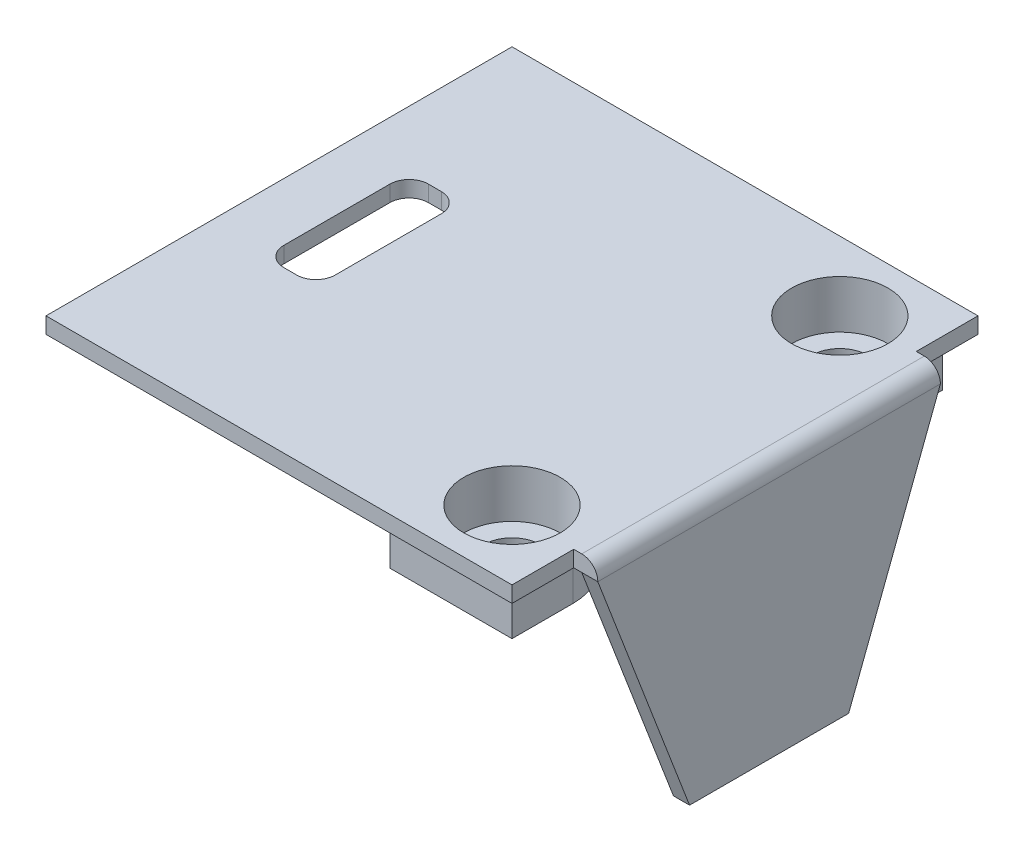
ISO-10303-21;
HEADER;
FILE_DESCRIPTION(('STEP AP214'),'2;1');
FILE_NAME('part.step','',(''),(''),'','','');
FILE_SCHEMA(('AUTOMOTIVE_DESIGN { 1 0 10303 214 1 1 1 1 }'));
ENDSEC;
DATA;
#1=APPLICATION_CONTEXT('core data for automotive mechanical design processes');
#2=APPLICATION_PROTOCOL_DEFINITION('international standard','automotive_design',2000,#1);
#3=PRODUCT_CONTEXT('',#1,'mechanical');
#4=PRODUCT('Part','Part','',(#3));
#5=PRODUCT_RELATED_PRODUCT_CATEGORY('part','',(#4));
#6=PRODUCT_DEFINITION_FORMATION('','',#4);
#7=PRODUCT_DEFINITION_CONTEXT('part definition',#1,'design');
#8=PRODUCT_DEFINITION('design','',#6,#7);
#9=PRODUCT_DEFINITION_SHAPE('','',#8);
#10=(LENGTH_UNIT() NAMED_UNIT(*) SI_UNIT(.MILLI.,.METRE.));
#11=(NAMED_UNIT(*) PLANE_ANGLE_UNIT() SI_UNIT($,.RADIAN.));
#12=(NAMED_UNIT(*) SI_UNIT($,.STERADIAN.) SOLID_ANGLE_UNIT());
#13=UNCERTAINTY_MEASURE_WITH_UNIT(LENGTH_MEASURE(1.E-05),#10,'distance_accuracy_value','');
#14=(GEOMETRIC_REPRESENTATION_CONTEXT(3) GLOBAL_UNCERTAINTY_ASSIGNED_CONTEXT((#13)) GLOBAL_UNIT_ASSIGNED_CONTEXT((#10,
#11,#12)) REPRESENTATION_CONTEXT('',''));
#15=CARTESIAN_POINT('',(0.,0.,0.));
#16=DIRECTION('',(0.,0.,1.));
#17=DIRECTION('',(1.,0.,0.));
#18=AXIS2_PLACEMENT_3D('',#15,#16,#17);
#19=CARTESIAN_POINT('',(10.2,-7.94974746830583,-10.2));
#20=DIRECTION('',(0.,1.,0.));
#21=DIRECTION('',(0.,0.,1.));
#22=AXIS2_PLACEMENT_3D('',#19,#20,#21);
#23=CYLINDRICAL_SURFACE('',#22,1.75);
#24=CARTESIAN_POINT('',(10.2,-3.,-10.2));
#25=DIRECTION('',(0.,-1.,0.));
#26=DIRECTION('',(0.,0.,-1.));
#27=AXIS2_PLACEMENT_3D('',#24,#25,#26);
#28=CIRCLE('',#27,1.75);
#29=CARTESIAN_POINT('',(10.2,-3.,-11.95));
#30=VERTEX_POINT('',#29);
#31=EDGE_CURVE('E305',#30,#30,#28,.T.);
#32=ORIENTED_EDGE('',*,*,#31,.T.);
#33=EDGE_LOOP('',(#32));
#34=FACE_BOUND('',#33,.T.);
#35=CARTESIAN_POINT('',(10.2,-2.,-10.2));
#36=DIRECTION('',(0.,1.,0.));
#37=DIRECTION('',(0.,0.,1.));
#38=AXIS2_PLACEMENT_3D('',#35,#36,#37);
#39=CIRCLE('',#38,1.75);
#40=CARTESIAN_POINT('',(10.2,-2.,-8.45));
#41=VERTEX_POINT('',#40);
#42=EDGE_CURVE('E302',#41,#41,#39,.T.);
#43=ORIENTED_EDGE('',*,*,#42,.T.);
#44=EDGE_LOOP('',(#43));
#45=FACE_BOUND('',#44,.T.);
#46=ADVANCED_FACE('F37',(#34,#45),#23,.F.);
#47=CARTESIAN_POINT('',(10.2,-7.94974746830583,10.2));
#48=DIRECTION('',(0.,1.,0.));
#49=DIRECTION('',(0.,0.,1.));
#50=AXIS2_PLACEMENT_3D('',#47,#48,#49);
#51=CYLINDRICAL_SURFACE('',#50,1.75);
#52=CARTESIAN_POINT('',(10.2,-3.,10.2));
#53=DIRECTION('',(0.,-1.,0.));
#54=DIRECTION('',(0.,0.,-1.));
#55=AXIS2_PLACEMENT_3D('',#52,#53,#54);
#56=CIRCLE('',#55,1.75);
#57=CARTESIAN_POINT('',(10.2,-3.,8.45));
#58=VERTEX_POINT('',#57);
#59=EDGE_CURVE('E347',#58,#58,#56,.F.);
#60=ORIENTED_EDGE('',*,*,#59,.F.);
#61=EDGE_LOOP('',(#60));
#62=FACE_BOUND('',#61,.T.);
#63=CARTESIAN_POINT('',(10.2,-2.,10.2));
#64=DIRECTION('',(0.,1.,0.));
#65=DIRECTION('',(0.,0.,1.));
#66=AXIS2_PLACEMENT_3D('',#63,#64,#65);
#67=CIRCLE('',#66,1.75);
#68=CARTESIAN_POINT('',(10.2,-2.,11.95));
#69=VERTEX_POINT('',#68);
#70=EDGE_CURVE('E344',#69,#69,#67,.F.);
#71=ORIENTED_EDGE('',*,*,#70,.F.);
#72=EDGE_LOOP('',(#71));
#73=FACE_BOUND('',#72,.T.);
#74=ADVANCED_FACE('F526',(#62,#73),#51,.F.);
#75=CARTESIAN_POINT('',(0.,0.,0.));
#76=DIRECTION('',(0.,-1.,0.));
#77=DIRECTION('',(0.,0.,-1.));
#78=AXIS2_PLACEMENT_3D('',#75,#76,#77);
#79=PLANE('',#78);
#80=DIRECTION('',(1.,0.,0.));
#81=VECTOR('',#80,1.);
#82=CARTESIAN_POINT('',(-9.7,0.,4.5));
#83=LINE('',#82,#81);
#84=CARTESIAN_POINT('',(-9.7,0.,4.5));
#85=VERTEX_POINT('',#84);
#86=CARTESIAN_POINT('',(-8.90000000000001,0.,4.5));
#87=VERTEX_POINT('',#86);
#88=EDGE_CURVE('E252',#85,#87,#83,.T.);
#89=ORIENTED_EDGE('',*,*,#88,.T.);
#90=CARTESIAN_POINT('',(-8.9,0.,3.3));
#91=DIRECTION('',(0.,-1.,0.));
#92=DIRECTION('',(0.,0.,-1.));
#93=AXIS2_PLACEMENT_3D('',#90,#91,#92);
#94=CIRCLE('',#93,1.2);
#95=CARTESIAN_POINT('',(-7.7,0.,3.29999999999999));
#96=VERTEX_POINT('',#95);
#97=EDGE_CURVE('E238',#87,#96,#94,.F.);
#98=ORIENTED_EDGE('',*,*,#97,.T.);
#99=DIRECTION('',(0.,0.,-1.));
#100=VECTOR('',#99,1.);
#101=CARTESIAN_POINT('',(-7.7,0.,-3.29999999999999));
#102=LINE('',#101,#100);
#103=CARTESIAN_POINT('',(-7.7,0.,-3.29999999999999));
#104=VERTEX_POINT('',#103);
#105=EDGE_CURVE('E288',#96,#104,#102,.T.);
#106=ORIENTED_EDGE('',*,*,#105,.T.);
#107=CARTESIAN_POINT('',(-8.9,0.,-3.3));
#108=DIRECTION('',(0.,-1.,0.));
#109=DIRECTION('',(0.,0.,-1.));
#110=AXIS2_PLACEMENT_3D('',#107,#108,#109);
#111=CIRCLE('',#110,1.2);
#112=CARTESIAN_POINT('',(-8.9,0.,-4.5));
#113=VERTEX_POINT('',#112);
#114=EDGE_CURVE('E284',#104,#113,#111,.F.);
#115=ORIENTED_EDGE('',*,*,#114,.T.);
#116=DIRECTION('',(-1.,0.,0.));
#117=VECTOR('',#116,1.);
#118=CARTESIAN_POINT('',(-9.7,0.,-4.5));
#119=LINE('',#118,#117);
#120=CARTESIAN_POINT('',(-9.7,0.,-4.5));
#121=VERTEX_POINT('',#120);
#122=EDGE_CURVE('E280',#113,#121,#119,.T.);
#123=ORIENTED_EDGE('',*,*,#122,.T.);
#124=CARTESIAN_POINT('',(-9.7,0.,-3.3));
#125=DIRECTION('',(0.,-1.,0.));
#126=DIRECTION('',(0.,0.,-1.));
#127=AXIS2_PLACEMENT_3D('',#124,#125,#126);
#128=CIRCLE('',#127,1.2);
#129=CARTESIAN_POINT('',(-10.9,0.,-3.29999999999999));
#130=VERTEX_POINT('',#129);
#131=EDGE_CURVE('E276',#121,#130,#128,.F.);
#132=ORIENTED_EDGE('',*,*,#131,.T.);
#133=DIRECTION('',(0.,0.,1.));
#134=VECTOR('',#133,1.);
#135=CARTESIAN_POINT('',(-10.9,0.,-3.29999999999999));
#136=LINE('',#135,#134);
#137=CARTESIAN_POINT('',(-10.9,0.,3.29999999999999));
#138=VERTEX_POINT('',#137);
#139=EDGE_CURVE('E273',#130,#138,#136,.T.);
#140=ORIENTED_EDGE('',*,*,#139,.T.);
#141=CARTESIAN_POINT('',(-9.7,0.,3.3));
#142=DIRECTION('',(0.,-1.,0.));
#143=DIRECTION('',(0.,0.,-1.));
#144=AXIS2_PLACEMENT_3D('',#141,#142,#143);
#145=CIRCLE('',#144,1.2);
#146=EDGE_CURVE('E261',#138,#85,#145,.F.);
#147=ORIENTED_EDGE('',*,*,#146,.T.);
#148=EDGE_LOOP('',(#89,#98,#106,#115,#123,#132,#140,#147));
#149=FACE_BOUND('',#148,.T.);
#150=CARTESIAN_POINT('',(9.6,0.,-9.6));
#151=DIRECTION('',(0.,1.,0.));
#152=DIRECTION('',(0.,0.,1.));
#153=AXIS2_PLACEMENT_3D('',#150,#151,#152);
#154=CIRCLE('',#153,3.8);
#155=CARTESIAN_POINT('',(5.8,0.,-9.6));
#156=VERTEX_POINT('',#155);
#157=CARTESIAN_POINT('',(13.4,0.,-9.6));
#158=VERTEX_POINT('',#157);
#159=EDGE_CURVE('E308',#156,#158,#154,.T.);
#160=ORIENTED_EDGE('',*,*,#159,.T.);
#161=DIRECTION('',(0.,0.,-1.));
#162=VECTOR('',#161,1.);
#163=CARTESIAN_POINT('',(13.4,0.,-9.6));
#164=LINE('',#163,#162);
#165=CARTESIAN_POINT('',(13.4,0.,-13.4));
#166=VERTEX_POINT('',#165);
#167=EDGE_CURVE('E313',#158,#166,#164,.T.);
#168=ORIENTED_EDGE('',*,*,#167,.T.);
#169=DIRECTION('',(-1.,0.,0.));
#170=VECTOR('',#169,1.);
#171=CARTESIAN_POINT('',(13.4,0.,-13.4));
#172=LINE('',#171,#170);
#173=CARTESIAN_POINT('',(5.8,0.,-13.4));
#174=VERTEX_POINT('',#173);
#175=EDGE_CURVE('E326',#166,#174,#172,.T.);
#176=ORIENTED_EDGE('',*,*,#175,.T.);
#177=DIRECTION('',(0.,0.,1.));
#178=VECTOR('',#177,1.);
#179=CARTESIAN_POINT('',(5.8,0.,-13.4));
#180=LINE('',#179,#178);
#181=EDGE_CURVE('E324',#174,#156,#180,.T.);
#182=ORIENTED_EDGE('',*,*,#181,.T.);
#183=EDGE_LOOP('',(#160,#168,#176,#182));
#184=FACE_BOUND('',#183,.T.);
#185=DIRECTION('',(0.,0.,1.));
#186=VECTOR('',#185,1.);
#187=CARTESIAN_POINT('',(-14.5,0.,-14.5));
#188=LINE('',#187,#186);
#189=CARTESIAN_POINT('',(-14.5,0.,-14.5));
#190=VERTEX_POINT('',#189);
#191=CARTESIAN_POINT('',(-14.5,0.,14.5));
#192=VERTEX_POINT('',#191);
#193=EDGE_CURVE('E449',#190,#192,#188,.T.);
#194=ORIENTED_EDGE('',*,*,#193,.F.);
#195=DIRECTION('',(-1.,0.,0.));
#196=VECTOR('',#195,1.);
#197=CARTESIAN_POINT('',(14.5,0.,-14.5));
#198=LINE('',#197,#196);
#199=CARTESIAN_POINT('',(14.5,0.,-14.5));
#200=VERTEX_POINT('',#199);
#201=EDGE_CURVE('E454',#200,#190,#198,.T.);
#202=ORIENTED_EDGE('',*,*,#201,.F.);
#203=DIRECTION('',(0.,0.,-1.));
#204=VECTOR('',#203,1.);
#205=CARTESIAN_POINT('',(14.5,0.,-14.5));
#206=LINE('',#205,#204);
#207=CARTESIAN_POINT('',(14.5,0.,-10.659553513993));
#208=VERTEX_POINT('',#207);
#209=EDGE_CURVE('E467',#208,#200,#206,.T.);
#210=ORIENTED_EDGE('',*,*,#209,.F.);
#211=DIRECTION('',(1.,0.,0.));
#212=VECTOR('',#211,1.);
#213=CARTESIAN_POINT('',(13.307113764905,0.,-10.659553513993));
#214=LINE('',#213,#212);
#215=CARTESIAN_POINT('',(15.0000000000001,0.,-10.659553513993));
#216=VERTEX_POINT('',#215);
#217=EDGE_CURVE('E393',#208,#216,#214,.T.);
#218=ORIENTED_EDGE('',*,*,#217,.T.);
#219=DIRECTION('',(0.,0.,1.));
#220=VECTOR('',#219,1.);
#221=CARTESIAN_POINT('',(15.0000000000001,0.,-10.659553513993));
#222=LINE('',#221,#220);
#223=CARTESIAN_POINT('',(15.0000000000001,0.,-10.0091862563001));
#224=VERTEX_POINT('',#223);
#225=EDGE_CURVE('E390',#216,#224,#222,.T.);
#226=ORIENTED_EDGE('',*,*,#225,.T.);
#227=DIRECTION('',(1.,0.,0.));
#228=VECTOR('',#227,1.);
#229=CARTESIAN_POINT('',(13.307113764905,0.,-10.0091862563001));
#230=LINE('',#229,#228);
#231=CARTESIAN_POINT('',(14.5,0.,-10.0091862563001));
#232=VERTEX_POINT('',#231);
#233=EDGE_CURVE('E382',#232,#224,#230,.T.);
#234=ORIENTED_EDGE('',*,*,#233,.F.);
#235=CARTESIAN_POINT('',(14.5,0.,10.0091862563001));
#236=VERTEX_POINT('',#235);
#237=EDGE_CURVE('E471',#236,#232,#206,.T.);
#238=ORIENTED_EDGE('',*,*,#237,.F.);
#239=DIRECTION('',(1.,0.,0.));
#240=VECTOR('',#239,1.);
#241=CARTESIAN_POINT('',(13.307113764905,0.,10.0091862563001));
#242=LINE('',#241,#240);
#243=CARTESIAN_POINT('',(15.0000000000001,0.,10.0091862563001));
#244=VERTEX_POINT('',#243);
#245=EDGE_CURVE('E380',#236,#244,#242,.T.);
#246=ORIENTED_EDGE('',*,*,#245,.T.);
#247=DIRECTION('',(0.,0.,1.));
#248=VECTOR('',#247,1.);
#249=CARTESIAN_POINT('',(15.0000000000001,0.,10.659553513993));
#250=LINE('',#249,#248);
#251=CARTESIAN_POINT('',(15.,0.,10.659553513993));
#252=VERTEX_POINT('',#251);
#253=EDGE_CURVE('E383',#244,#252,#250,.T.);
#254=ORIENTED_EDGE('',*,*,#253,.T.);
#255=DIRECTION('',(1.,0.,0.));
#256=VECTOR('',#255,1.);
#257=CARTESIAN_POINT('',(13.307113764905,0.,10.659553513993));
#258=LINE('',#257,#256);
#259=CARTESIAN_POINT('',(14.5,0.,10.659553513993));
#260=VERTEX_POINT('',#259);
#261=EDGE_CURVE('E384',#260,#252,#258,.T.);
#262=ORIENTED_EDGE('',*,*,#261,.F.);
#263=CARTESIAN_POINT('',(14.5,0.,14.5));
#264=VERTEX_POINT('',#263);
#265=EDGE_CURVE('E468',#264,#260,#206,.T.);
#266=ORIENTED_EDGE('',*,*,#265,.F.);
#267=DIRECTION('',(1.,0.,0.));
#268=VECTOR('',#267,1.);
#269=CARTESIAN_POINT('',(14.5,0.,14.5));
#270=LINE('',#269,#268);
#271=EDGE_CURVE('E465',#192,#264,#270,.T.);
#272=ORIENTED_EDGE('',*,*,#271,.F.);
#273=EDGE_LOOP('',(#194,#202,#210,#218,#226,#234,#238,#246,#254,#262,#266,#272));
#274=FACE_BOUND('',#273,.T.);
#275=DIRECTION('',(0.,0.,1.));
#276=VECTOR('',#275,1.);
#277=CARTESIAN_POINT('',(13.4,0.,9.6));
#278=LINE('',#277,#276);
#279=CARTESIAN_POINT('',(13.4,0.,9.6));
#280=VERTEX_POINT('',#279);
#281=CARTESIAN_POINT('',(13.4,0.,13.4));
#282=VERTEX_POINT('',#281);
#283=EDGE_CURVE('E364',#280,#282,#278,.T.);
#284=ORIENTED_EDGE('',*,*,#283,.F.);
#285=CARTESIAN_POINT('',(9.6,0.,9.6));
#286=DIRECTION('',(0.,-1.,0.));
#287=DIRECTION('',(0.,0.,-1.));
#288=AXIS2_PLACEMENT_3D('',#285,#286,#287);
#289=CIRCLE('',#288,3.8);
#290=CARTESIAN_POINT('',(5.8,0.,9.6));
#291=VERTEX_POINT('',#290);
#292=EDGE_CURVE('E350',#291,#280,#289,.T.);
#293=ORIENTED_EDGE('',*,*,#292,.F.);
#294=DIRECTION('',(0.,0.,-1.));
#295=VECTOR('',#294,1.);
#296=CARTESIAN_POINT('',(5.8,0.,13.4));
#297=LINE('',#296,#295);
#298=CARTESIAN_POINT('',(5.8,0.,13.4));
#299=VERTEX_POINT('',#298);
#300=EDGE_CURVE('E355',#299,#291,#297,.T.);
#301=ORIENTED_EDGE('',*,*,#300,.F.);
#302=DIRECTION('',(-1.,0.,0.));
#303=VECTOR('',#302,1.);
#304=CARTESIAN_POINT('',(13.4,0.,13.4));
#305=LINE('',#304,#303);
#306=EDGE_CURVE('E366',#282,#299,#305,.T.);
#307=ORIENTED_EDGE('',*,*,#306,.F.);
#308=EDGE_LOOP('',(#284,#293,#301,#307));
#309=FACE_BOUND('',#308,.T.);
#310=ADVANCED_FACE('F258',(#149,#184,#274,#309),#79,.T.);
#311=CARTESIAN_POINT('',(15.0000000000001,0.,0.));
#312=DIRECTION('',(-1.,0.,0.));
#313=DIRECTION('',(0.,-1.,0.));
#314=AXIS2_PLACEMENT_3D('',#311,#312,#313);
#315=PLANE('',#314);
#316=DIRECTION('',(0.,-0.933790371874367,-0.357820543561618));
#317=VECTOR('',#316,1.);
#318=CARTESIAN_POINT('',(15.,0.,10.659553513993));
#319=LINE('',#318,#317);
#320=CARTESIAN_POINT('',(15.,-14.9,4.95));
#321=VERTEX_POINT('',#320);
#322=EDGE_CURVE('E400',#252,#321,#319,.T.);
#323=ORIENTED_EDGE('',*,*,#322,.F.);
#324=ORIENTED_EDGE('',*,*,#253,.F.);
#325=DIRECTION('',(0.,0.939692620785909,0.342020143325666));
#326=VECTOR('',#325,1.);
#327=CARTESIAN_POINT('',(15.,-13.9,4.95));
#328=LINE('',#327,#326);
#329=CARTESIAN_POINT('',(15.,-13.9,4.95));
#330=VERTEX_POINT('',#329);
#331=EDGE_CURVE('E433',#330,#244,#328,.T.);
#332=ORIENTED_EDGE('',*,*,#331,.F.);
#333=DIRECTION('',(0.,0.,1.));
#334=VECTOR('',#333,1.);
#335=CARTESIAN_POINT('',(15.,-13.9,-4.95));
#336=LINE('',#335,#334);
#337=CARTESIAN_POINT('',(15.,-13.9,-4.95000000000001));
#338=VERTEX_POINT('',#337);
#339=EDGE_CURVE('E421',#338,#330,#336,.T.);
#340=ORIENTED_EDGE('',*,*,#339,.F.);
#341=DIRECTION('',(0.,-0.93969262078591,0.342020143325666));
#342=VECTOR('',#341,1.);
#343=CARTESIAN_POINT('',(15.0000000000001,1.,-10.3731564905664));
#344=LINE('',#343,#342);
#345=EDGE_CURVE('E484',#224,#338,#344,.T.);
#346=ORIENTED_EDGE('',*,*,#345,.F.);
#347=ORIENTED_EDGE('',*,*,#225,.F.);
#348=DIRECTION('',(0.,0.933790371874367,-0.357820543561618));
#349=VECTOR('',#348,1.);
#350=CARTESIAN_POINT('',(15.,0.,-10.659553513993));
#351=LINE('',#350,#349);
#352=CARTESIAN_POINT('',(15.,-14.9,-4.95000000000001));
#353=VERTEX_POINT('',#352);
#354=EDGE_CURVE('E407',#353,#216,#351,.T.);
#355=ORIENTED_EDGE('',*,*,#354,.F.);
#356=DIRECTION('',(0.,0.,-1.));
#357=VECTOR('',#356,1.);
#358=CARTESIAN_POINT('',(15.,-14.9,-4.95000000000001));
#359=LINE('',#358,#357);
#360=EDGE_CURVE('E403',#321,#353,#359,.T.);
#361=ORIENTED_EDGE('',*,*,#360,.F.);
#362=EDGE_LOOP('',(#323,#324,#332,#340,#346,#347,#355,#361));
#363=FACE_BOUND('',#362,.T.);
#364=ADVANCED_FACE('F587',(#363),#315,.T.);
#365=CARTESIAN_POINT('',(14.5,1.,-14.5));
#366=DIRECTION('',(-1.,0.,0.));
#367=DIRECTION('',(0.,0.,1.));
#368=AXIS2_PLACEMENT_3D('',#365,#366,#367);
#369=PLANE('',#368);
#370=DIRECTION('',(0.,1.,0.));
#371=VECTOR('',#370,1.);
#372=CARTESIAN_POINT('',(14.5,1.00000000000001,10.659553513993));
#373=LINE('',#372,#371);
#374=CARTESIAN_POINT('',(14.5,1.,10.659553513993));
#375=VERTEX_POINT('',#374);
#376=EDGE_CURVE('E379',#260,#375,#373,.T.);
#377=ORIENTED_EDGE('',*,*,#376,.T.);
#378=DIRECTION('',(0.,0.,-1.));
#379=VECTOR('',#378,1.);
#380=CARTESIAN_POINT('',(14.5,1.,-14.5));
#381=LINE('',#380,#379);
#382=CARTESIAN_POINT('',(14.5,1.,14.5));
#383=VERTEX_POINT('',#382);
#384=EDGE_CURVE('E457',#383,#375,#381,.T.);
#385=ORIENTED_EDGE('',*,*,#384,.F.);
#386=DIRECTION('',(0.,-1.,0.));
#387=VECTOR('',#386,1.);
#388=CARTESIAN_POINT('',(14.5,1.,14.5));
#389=LINE('',#388,#387);
#390=EDGE_CURVE('E478',#383,#264,#389,.T.);
#391=ORIENTED_EDGE('',*,*,#390,.T.);
#392=ORIENTED_EDGE('',*,*,#265,.T.);
#393=EDGE_LOOP('',(#377,#385,#391,#392));
#394=FACE_BOUND('',#393,.T.);
#395=ADVANCED_FACE('F590',(#394),#369,.F.);
#396=CARTESIAN_POINT('',(16.,-13.9,4.95));
#397=DIRECTION('',(0.,0.342020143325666,-0.939692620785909));
#398=DIRECTION('',(0.,0.939692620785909,0.342020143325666));
#399=AXIS2_PLACEMENT_3D('',#396,#397,#398);
#400=PLANE('',#399);
#401=ORIENTED_EDGE('',*,*,#245,.F.);
#402=DIRECTION('',(0.,-0.939692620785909,-0.342020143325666));
#403=VECTOR('',#402,1.);
#404=CARTESIAN_POINT('',(14.5,-13.9,4.95));
#405=LINE('',#404,#403);
#406=CARTESIAN_POINT('',(14.5,-13.9,4.95));
#407=VERTEX_POINT('',#406);
#408=EDGE_CURVE('E436',#236,#407,#405,.T.);
#409=ORIENTED_EDGE('',*,*,#408,.T.);
#410=DIRECTION('',(-1.,0.,0.));
#411=VECTOR('',#410,1.);
#412=CARTESIAN_POINT('',(16.,-13.9,4.95));
#413=LINE('',#412,#411);
#414=EDGE_CURVE('E447',#330,#407,#413,.T.);
#415=ORIENTED_EDGE('',*,*,#414,.F.);
#416=ORIENTED_EDGE('',*,*,#331,.T.);
#417=EDGE_LOOP('',(#401,#409,#415,#416));
#418=FACE_BOUND('',#417,.T.);
#419=ADVANCED_FACE('F619',(#418),#400,.F.);
#420=DIRECTION('',(0.,-1.,0.));
#421=VECTOR('',#420,1.);
#422=CARTESIAN_POINT('',(14.5,1.00000000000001,-10.659553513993));
#423=LINE('',#422,#421);
#424=CARTESIAN_POINT('',(14.5,1.,-10.659553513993));
#425=VERTEX_POINT('',#424);
#426=EDGE_CURVE('E392',#425,#208,#423,.T.);
#427=ORIENTED_EDGE('',*,*,#426,.T.);
#428=ORIENTED_EDGE('',*,*,#209,.T.);
#429=DIRECTION('',(0.,-1.,0.));
#430=VECTOR('',#429,1.);
#431=CARTESIAN_POINT('',(14.5,1.,-14.5));
#432=LINE('',#431,#430);
#433=CARTESIAN_POINT('',(14.5,1.,-14.5));
#434=VERTEX_POINT('',#433);
#435=EDGE_CURVE('E475',#434,#200,#432,.T.);
#436=ORIENTED_EDGE('',*,*,#435,.F.);
#437=EDGE_CURVE('E456',#425,#434,#381,.T.);
#438=ORIENTED_EDGE('',*,*,#437,.F.);
#439=EDGE_LOOP('',(#427,#428,#436,#438));
#440=FACE_BOUND('',#439,.T.);
#441=ADVANCED_FACE('F613',(#440),#369,.F.);
#442=CARTESIAN_POINT('',(16.,1.,-10.3731564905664));
#443=DIRECTION('',(0.,0.342020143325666,0.939692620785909));
#444=DIRECTION('',(0.,-0.93969262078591,0.342020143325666));
#445=AXIS2_PLACEMENT_3D('',#442,#443,#444);
#446=PLANE('',#445);
#447=ORIENTED_EDGE('',*,*,#233,.T.);
#448=ORIENTED_EDGE('',*,*,#345,.T.);
#449=DIRECTION('',(-1.,0.,0.));
#450=VECTOR('',#449,1.);
#451=CARTESIAN_POINT('',(16.,-13.9,-4.95));
#452=LINE('',#451,#450);
#453=CARTESIAN_POINT('',(14.5,-13.9,-4.95));
#454=VERTEX_POINT('',#453);
#455=EDGE_CURVE('E445',#338,#454,#452,.T.);
#456=ORIENTED_EDGE('',*,*,#455,.T.);
#457=DIRECTION('',(0.,0.93969262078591,-0.342020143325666));
#458=VECTOR('',#457,1.);
#459=CARTESIAN_POINT('',(14.5,1.,-10.3731564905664));
#460=LINE('',#459,#458);
#461=EDGE_CURVE('E442',#454,#232,#460,.T.);
#462=ORIENTED_EDGE('',*,*,#461,.T.);
#463=EDGE_LOOP('',(#447,#448,#456,#462));
#464=FACE_BOUND('',#463,.T.);
#465=ADVANCED_FACE('F609',(#464),#446,.F.);
#466=CARTESIAN_POINT('',(-14.5,1.,-14.5));
#467=DIRECTION('',(1.,0.,0.));
#468=DIRECTION('',(0.,0.,-1.));
#469=AXIS2_PLACEMENT_3D('',#466,#467,#468);
#470=PLANE('',#469);
#471=ORIENTED_EDGE('',*,*,#193,.T.);
#472=DIRECTION('',(0.,-1.,0.));
#473=VECTOR('',#472,1.);
#474=CARTESIAN_POINT('',(-14.5,1.,14.5));
#475=LINE('',#474,#473);
#476=CARTESIAN_POINT('',(-14.5,1.,14.5));
#477=VERTEX_POINT('',#476);
#478=EDGE_CURVE('E481',#477,#192,#475,.T.);
#479=ORIENTED_EDGE('',*,*,#478,.F.);
#480=DIRECTION('',(0.,0.,1.));
#481=VECTOR('',#480,1.);
#482=CARTESIAN_POINT('',(-14.5,1.,-14.5));
#483=LINE('',#482,#481);
#484=CARTESIAN_POINT('',(-14.5,1.,-14.5));
#485=VERTEX_POINT('',#484);
#486=EDGE_CURVE('E450',#485,#477,#483,.T.);
#487=ORIENTED_EDGE('',*,*,#486,.F.);
#488=DIRECTION('',(0.,-1.,0.));
#489=VECTOR('',#488,1.);
#490=CARTESIAN_POINT('',(-14.5,1.,-14.5));
#491=LINE('',#490,#489);
#492=EDGE_CURVE('E462',#485,#190,#491,.T.);
#493=ORIENTED_EDGE('',*,*,#492,.T.);
#494=EDGE_LOOP('',(#471,#479,#487,#493));
#495=FACE_BOUND('',#494,.T.);
#496=ADVANCED_FACE('F612',(#495),#470,.F.);
#497=CARTESIAN_POINT('',(14.5,1.,14.5));
#498=DIRECTION('',(0.,0.,-1.));
#499=DIRECTION('',(-1.,0.,0.));
#500=AXIS2_PLACEMENT_3D('',#497,#498,#499);
#501=PLANE('',#500);
#502=ORIENTED_EDGE('',*,*,#271,.T.);
#503=ORIENTED_EDGE('',*,*,#390,.F.);
#504=DIRECTION('',(1.,0.,0.));
#505=VECTOR('',#504,1.);
#506=CARTESIAN_POINT('',(14.5,1.,14.5));
#507=LINE('',#506,#505);
#508=EDGE_CURVE('E453',#477,#383,#507,.T.);
#509=ORIENTED_EDGE('',*,*,#508,.F.);
#510=ORIENTED_EDGE('',*,*,#478,.T.);
#511=EDGE_LOOP('',(#502,#503,#509,#510));
#512=FACE_BOUND('',#511,.T.);
#513=ADVANCED_FACE('F631',(#512),#501,.F.);
#514=CARTESIAN_POINT('',(14.5,1.,-14.5));
#515=DIRECTION('',(0.,0.,1.));
#516=DIRECTION('',(1.,0.,0.));
#517=AXIS2_PLACEMENT_3D('',#514,#515,#516);
#518=PLANE('',#517);
#519=ORIENTED_EDGE('',*,*,#201,.T.);
#520=ORIENTED_EDGE('',*,*,#492,.F.);
#521=DIRECTION('',(-1.,0.,0.));
#522=VECTOR('',#521,1.);
#523=CARTESIAN_POINT('',(14.5,1.,-14.5));
#524=LINE('',#523,#522);
#525=EDGE_CURVE('E460',#434,#485,#524,.T.);
#526=ORIENTED_EDGE('',*,*,#525,.F.);
#527=ORIENTED_EDGE('',*,*,#435,.T.);
#528=EDGE_LOOP('',(#519,#520,#526,#527));
#529=FACE_BOUND('',#528,.T.);
#530=ADVANCED_FACE('F625',(#529),#518,.F.);
#531=CARTESIAN_POINT('',(0.,1.,0.));
#532=DIRECTION('',(0.,-1.,0.));
#533=DIRECTION('',(0.,0.,-1.));
#534=AXIS2_PLACEMENT_3D('',#531,#532,#533);
#535=PLANE('',#534);
#536=CARTESIAN_POINT('',(-8.9,1.,3.3));
#537=DIRECTION('',(0.,1.,0.));
#538=DIRECTION('',(0.,0.,1.));
#539=AXIS2_PLACEMENT_3D('',#536,#537,#538);
#540=CIRCLE('',#539,1.2);
#541=CARTESIAN_POINT('',(-8.90000000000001,1.,4.5));
#542=VERTEX_POINT('',#541);
#543=CARTESIAN_POINT('',(-7.7,1.,3.29999999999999));
#544=VERTEX_POINT('',#543);
#545=EDGE_CURVE('E1064',#542,#544,#540,.T.);
#546=ORIENTED_EDGE('',*,*,#545,.F.);
#547=DIRECTION('',(1.,0.,0.));
#548=VECTOR('',#547,1.);
#549=CARTESIAN_POINT('',(-9.7,1.,4.5));
#550=LINE('',#549,#548);
#551=CARTESIAN_POINT('',(-9.7,1.,4.5));
#552=VERTEX_POINT('',#551);
#553=EDGE_CURVE('E255',#552,#542,#550,.T.);
#554=ORIENTED_EDGE('',*,*,#553,.F.);
#555=CARTESIAN_POINT('',(-9.7,1.,3.3));
#556=DIRECTION('',(0.,1.,0.));
#557=DIRECTION('',(0.,0.,1.));
#558=AXIS2_PLACEMENT_3D('',#555,#556,#557);
#559=CIRCLE('',#558,1.2);
#560=CARTESIAN_POINT('',(-10.9,1.,3.29999999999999));
#561=VERTEX_POINT('',#560);
#562=EDGE_CURVE('E268',#561,#552,#559,.T.);
#563=ORIENTED_EDGE('',*,*,#562,.F.);
#564=DIRECTION('',(0.,0.,1.));
#565=VECTOR('',#564,1.);
#566=CARTESIAN_POINT('',(-10.9,1.,-3.29999999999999));
#567=LINE('',#566,#565);
#568=CARTESIAN_POINT('',(-10.9,1.,-3.29999999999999));
#569=VERTEX_POINT('',#568);
#570=EDGE_CURVE('E262',#569,#561,#567,.T.);
#571=ORIENTED_EDGE('',*,*,#570,.F.);
#572=CARTESIAN_POINT('',(-9.7,1.,-3.3));
#573=DIRECTION('',(0.,1.,0.));
#574=DIRECTION('',(0.,0.,1.));
#575=AXIS2_PLACEMENT_3D('',#572,#573,#574);
#576=CIRCLE('',#575,1.2);
#577=CARTESIAN_POINT('',(-9.7,1.,-4.5));
#578=VERTEX_POINT('',#577);
#579=EDGE_CURVE('E264',#578,#569,#576,.T.);
#580=ORIENTED_EDGE('',*,*,#579,.F.);
#581=DIRECTION('',(-1.,0.,0.));
#582=VECTOR('',#581,1.);
#583=CARTESIAN_POINT('',(-9.7,1.,-4.5));
#584=LINE('',#583,#582);
#585=CARTESIAN_POINT('',(-8.90000000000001,1.,-4.5));
#586=VERTEX_POINT('',#585);
#587=EDGE_CURVE('E1059',#586,#578,#584,.T.);
#588=ORIENTED_EDGE('',*,*,#587,.F.);
#589=CARTESIAN_POINT('',(-8.9,1.,-3.3));
#590=DIRECTION('',(0.,1.,0.));
#591=DIRECTION('',(0.,0.,-1.));
#592=AXIS2_PLACEMENT_3D('',#589,#590,#591);
#593=CIRCLE('',#592,1.2);
#594=CARTESIAN_POINT('',(-7.7,1.,-3.29999999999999));
#595=VERTEX_POINT('',#594);
#596=EDGE_CURVE('E1070',#595,#586,#593,.T.);
#597=ORIENTED_EDGE('',*,*,#596,.F.);
#598=DIRECTION('',(0.,0.,-1.));
#599=VECTOR('',#598,1.);
#600=CARTESIAN_POINT('',(-7.7,1.,-3.29999999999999));
#601=LINE('',#600,#599);
#602=EDGE_CURVE('E1065',#544,#595,#601,.T.);
#603=ORIENTED_EDGE('',*,*,#602,.F.);
#604=EDGE_LOOP('',(#546,#554,#563,#571,#580,#588,#597,#603));
#605=FACE_BOUND('',#604,.T.);
#606=CARTESIAN_POINT('',(10.2,1.,-10.2));
#607=DIRECTION('',(0.,-1.,0.));
#608=DIRECTION('',(0.,0.,-1.));
#609=AXIS2_PLACEMENT_3D('',#606,#607,#608);
#610=CIRCLE('',#609,3.);
#611=CARTESIAN_POINT('',(10.2,1.,-13.2));
#612=VERTEX_POINT('',#611);
#613=EDGE_CURVE('E298',#612,#612,#610,.T.);
#614=ORIENTED_EDGE('',*,*,#613,.T.);
#615=EDGE_LOOP('',(#614));
#616=FACE_BOUND('',#615,.T.);
#617=CARTESIAN_POINT('',(10.2,1.,10.2));
#618=DIRECTION('',(0.,1.,0.));
#619=DIRECTION('',(0.,0.,1.));
#620=AXIS2_PLACEMENT_3D('',#617,#618,#619);
#621=CIRCLE('',#620,3.);
#622=CARTESIAN_POINT('',(10.2,1.,13.2));
#623=VERTEX_POINT('',#622);
#624=EDGE_CURVE('E340',#623,#623,#621,.T.);
#625=ORIENTED_EDGE('',*,*,#624,.F.);
#626=EDGE_LOOP('',(#625));
#627=FACE_BOUND('',#626,.T.);
#628=DIRECTION('',(1.,0.,0.));
#629=VECTOR('',#628,1.);
#630=CARTESIAN_POINT('',(15.,0.999999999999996,10.659553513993));
#631=LINE('',#630,#629);
#632=CARTESIAN_POINT('',(15.,0.999999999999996,10.659553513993));
#633=VERTEX_POINT('',#632);
#634=EDGE_CURVE('E428',#375,#633,#631,.T.);
#635=ORIENTED_EDGE('',*,*,#634,.T.);
#636=DIRECTION('',(0.,0.,1.));
#637=VECTOR('',#636,1.);
#638=CARTESIAN_POINT('',(15.,1.,0.));
#639=LINE('',#638,#637);
#640=CARTESIAN_POINT('',(15.,1.,-10.659553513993));
#641=VERTEX_POINT('',#640);
#642=EDGE_CURVE('E45',#633,#641,#639,.F.);
#643=ORIENTED_EDGE('',*,*,#642,.T.);
#644=DIRECTION('',(1.,0.,0.));
#645=VECTOR('',#644,1.);
#646=CARTESIAN_POINT('',(15.,1.,-10.659553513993));
#647=LINE('',#646,#645);
#648=EDGE_CURVE('E410',#425,#641,#647,.T.);
#649=ORIENTED_EDGE('',*,*,#648,.F.);
#650=ORIENTED_EDGE('',*,*,#437,.T.);
#651=ORIENTED_EDGE('',*,*,#525,.T.);
#652=ORIENTED_EDGE('',*,*,#486,.T.);
#653=ORIENTED_EDGE('',*,*,#508,.T.);
#654=ORIENTED_EDGE('',*,*,#384,.T.);
#655=EDGE_LOOP('',(#635,#643,#649,#650,#651,#652,#653,#654));
#656=FACE_BOUND('',#655,.T.);
#657=ADVANCED_FACE('F617',(#605,#616,#627,#656),#535,.F.);
#658=CARTESIAN_POINT('',(16.,-13.9,-4.95));
#659=DIRECTION('',(0.,1.,0.));
#660=DIRECTION('',(0.,0.,1.));
#661=AXIS2_PLACEMENT_3D('',#658,#659,#660);
#662=PLANE('',#661);
#663=ORIENTED_EDGE('',*,*,#455,.F.);
#664=ORIENTED_EDGE('',*,*,#339,.T.);
#665=ORIENTED_EDGE('',*,*,#414,.T.);
#666=DIRECTION('',(0.,0.,-1.));
#667=VECTOR('',#666,1.);
#668=CARTESIAN_POINT('',(14.5,-13.9,-4.95));
#669=LINE('',#668,#667);
#670=EDGE_CURVE('E439',#407,#454,#669,.T.);
#671=ORIENTED_EDGE('',*,*,#670,.T.);
#672=EDGE_LOOP('',(#663,#664,#665,#671));
#673=FACE_BOUND('',#672,.T.);
#674=ADVANCED_FACE('F605',(#673),#662,.F.);
#675=CARTESIAN_POINT('',(16.,0.,0.));
#676=DIRECTION('',(-1.,0.,0.));
#677=DIRECTION('',(0.,0.,1.));
#678=AXIS2_PLACEMENT_3D('',#675,#676,#677);
#679=PLANE('',#678);
#680=DIRECTION('',(0.,0.933790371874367,-0.357820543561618));
#681=VECTOR('',#680,1.);
#682=CARTESIAN_POINT('',(16.,0.,-10.659553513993));
#683=LINE('',#682,#681);
#684=CARTESIAN_POINT('',(16.,-14.9,-4.95000000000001));
#685=VERTEX_POINT('',#684);
#686=CARTESIAN_POINT('',(16.,0.,-10.659553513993));
#687=VERTEX_POINT('',#686);
#688=EDGE_CURVE('E404',#685,#687,#683,.T.);
#689=ORIENTED_EDGE('',*,*,#688,.T.);
#690=DIRECTION('',(0.,0.,1.));
#691=VECTOR('',#690,1.);
#692=CARTESIAN_POINT('',(16.,0.,0.));
#693=LINE('',#692,#691);
#694=CARTESIAN_POINT('',(16.,0.,10.659553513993));
#695=VERTEX_POINT('',#694);
#696=EDGE_CURVE('E486',#687,#695,#693,.T.);
#697=ORIENTED_EDGE('',*,*,#696,.T.);
#698=DIRECTION('',(0.,-0.933790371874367,-0.357820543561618));
#699=VECTOR('',#698,1.);
#700=CARTESIAN_POINT('',(16.,0.,10.659553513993));
#701=LINE('',#700,#699);
#702=CARTESIAN_POINT('',(16.,-14.9,4.95));
#703=VERTEX_POINT('',#702);
#704=EDGE_CURVE('E396',#695,#703,#701,.T.);
#705=ORIENTED_EDGE('',*,*,#704,.T.);
#706=DIRECTION('',(0.,0.,-1.));
#707=VECTOR('',#706,1.);
#708=CARTESIAN_POINT('',(16.,-14.9,-4.95000000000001));
#709=LINE('',#708,#707);
#710=EDGE_CURVE('E413',#703,#685,#709,.T.);
#711=ORIENTED_EDGE('',*,*,#710,.T.);
#712=EDGE_LOOP('',(#689,#697,#705,#711));
#713=FACE_BOUND('',#712,.T.);
#714=ADVANCED_FACE('F495',(#713),#679,.F.);
#715=CARTESIAN_POINT('',(14.5,0.,0.));
#716=DIRECTION('',(-1.,0.,0.));
#717=DIRECTION('',(0.,0.,1.));
#718=AXIS2_PLACEMENT_3D('',#715,#716,#717);
#719=PLANE('',#718);
#720=ORIENTED_EDGE('',*,*,#408,.F.);
#721=ORIENTED_EDGE('',*,*,#237,.T.);
#722=ORIENTED_EDGE('',*,*,#461,.F.);
#723=ORIENTED_EDGE('',*,*,#670,.F.);
#724=EDGE_LOOP('',(#720,#721,#722,#723));
#725=FACE_BOUND('',#724,.T.);
#726=ADVANCED_FACE('F602',(#725),#719,.T.);
#727=CARTESIAN_POINT('',(15.,1.,-10.659553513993));
#728=DIRECTION('',(0.,0.,-1.));
#729=DIRECTION('',(-1.,0.,0.));
#730=AXIS2_PLACEMENT_3D('',#727,#728,#729);
#731=PLANE('',#730);
#732=ORIENTED_EDGE('',*,*,#648,.T.);
#733=CARTESIAN_POINT('',(15.,0.,-10.659553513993));
#734=DIRECTION('',(0.,0.,-1.));
#735=DIRECTION('',(-1.,0.,0.));
#736=AXIS2_PLACEMENT_3D('',#733,#734,#735);
#737=CIRCLE('',#736,1.);
#738=EDGE_CURVE('E11',#641,#687,#737,.T.);
#739=ORIENTED_EDGE('',*,*,#738,.T.);
#740=DIRECTION('',(1.,0.,0.));
#741=VECTOR('',#740,1.);
#742=CARTESIAN_POINT('',(15.,0.,-10.659553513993));
#743=LINE('',#742,#741);
#744=EDGE_CURVE('E418',#216,#687,#743,.T.);
#745=ORIENTED_EDGE('',*,*,#744,.F.);
#746=ORIENTED_EDGE('',*,*,#217,.F.);
#747=ORIENTED_EDGE('',*,*,#426,.F.);
#748=EDGE_LOOP('',(#732,#739,#745,#746,#747));
#749=FACE_BOUND('',#748,.T.);
#750=ADVANCED_FACE('F515',(#749),#731,.T.);
#751=CARTESIAN_POINT('',(15.,0.,-10.659553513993));
#752=DIRECTION('',(0.,-0.357820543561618,-0.933790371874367));
#753=DIRECTION('',(0.,0.933790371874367,-0.357820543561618));
#754=AXIS2_PLACEMENT_3D('',#751,#752,#753);
#755=PLANE('',#754);
#756=ORIENTED_EDGE('',*,*,#688,.F.);
#757=DIRECTION('',(1.,0.,0.));
#758=VECTOR('',#757,1.);
#759=CARTESIAN_POINT('',(15.,-14.9,-4.95000000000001));
#760=LINE('',#759,#758);
#761=EDGE_CURVE('E422',#353,#685,#760,.T.);
#762=ORIENTED_EDGE('',*,*,#761,.F.);
#763=ORIENTED_EDGE('',*,*,#354,.T.);
#764=ORIENTED_EDGE('',*,*,#744,.T.);
#765=EDGE_LOOP('',(#756,#762,#763,#764));
#766=FACE_BOUND('',#765,.T.);
#767=ADVANCED_FACE('F511',(#766),#755,.T.);
#768=CARTESIAN_POINT('',(15.,-14.9,-4.95000000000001));
#769=DIRECTION('',(0.,-1.,0.));
#770=DIRECTION('',(1.,0.,0.));
#771=AXIS2_PLACEMENT_3D('',#768,#769,#770);
#772=PLANE('',#771);
#773=ORIENTED_EDGE('',*,*,#710,.F.);
#774=DIRECTION('',(1.,0.,0.));
#775=VECTOR('',#774,1.);
#776=CARTESIAN_POINT('',(15.,-14.9,4.95));
#777=LINE('',#776,#775);
#778=EDGE_CURVE('E424',#321,#703,#777,.T.);
#779=ORIENTED_EDGE('',*,*,#778,.F.);
#780=ORIENTED_EDGE('',*,*,#360,.T.);
#781=ORIENTED_EDGE('',*,*,#761,.T.);
#782=EDGE_LOOP('',(#773,#779,#780,#781));
#783=FACE_BOUND('',#782,.T.);
#784=ADVANCED_FACE('F509',(#783),#772,.T.);
#785=CARTESIAN_POINT('',(15.,0.,10.659553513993));
#786=DIRECTION('',(0.,-0.357820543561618,0.933790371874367));
#787=DIRECTION('',(0.,-0.933790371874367,-0.357820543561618));
#788=AXIS2_PLACEMENT_3D('',#785,#786,#787);
#789=PLANE('',#788);
#790=ORIENTED_EDGE('',*,*,#704,.F.);
#791=DIRECTION('',(1.,0.,0.));
#792=VECTOR('',#791,1.);
#793=CARTESIAN_POINT('',(15.,0.,10.659553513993));
#794=LINE('',#793,#792);
#795=EDGE_CURVE('E426',#252,#695,#794,.T.);
#796=ORIENTED_EDGE('',*,*,#795,.F.);
#797=ORIENTED_EDGE('',*,*,#322,.T.);
#798=ORIENTED_EDGE('',*,*,#778,.T.);
#799=EDGE_LOOP('',(#790,#796,#797,#798));
#800=FACE_BOUND('',#799,.T.);
#801=ADVANCED_FACE('F505',(#800),#789,.T.);
#802=CARTESIAN_POINT('',(15.,0.999999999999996,10.659553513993));
#803=DIRECTION('',(0.,0.,1.));
#804=DIRECTION('',(1.,0.,0.));
#805=AXIS2_PLACEMENT_3D('',#802,#803,#804);
#806=PLANE('',#805);
#807=ORIENTED_EDGE('',*,*,#795,.T.);
#808=CARTESIAN_POINT('',(15.,0.,10.659553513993));
#809=DIRECTION('',(0.,0.,1.));
#810=DIRECTION('',(1.,0.,0.));
#811=AXIS2_PLACEMENT_3D('',#808,#809,#810);
#812=CIRCLE('',#811,1.);
#813=EDGE_CURVE('E59',#695,#633,#812,.T.);
#814=ORIENTED_EDGE('',*,*,#813,.T.);
#815=ORIENTED_EDGE('',*,*,#634,.F.);
#816=ORIENTED_EDGE('',*,*,#376,.F.);
#817=ORIENTED_EDGE('',*,*,#261,.T.);
#818=EDGE_LOOP('',(#807,#814,#815,#816,#817));
#819=FACE_BOUND('',#818,.T.);
#820=ADVANCED_FACE('F501',(#819),#806,.T.);
#821=CARTESIAN_POINT('',(9.6,-3.,9.6));
#822=DIRECTION('',(0.,1.,0.));
#823=DIRECTION('',(0.,0.,1.));
#824=AXIS2_PLACEMENT_3D('',#821,#822,#823);
#825=CYLINDRICAL_SURFACE('',#824,3.8);
#826=ORIENTED_EDGE('',*,*,#292,.T.);
#827=DIRECTION('',(0.,1.,0.));
#828=VECTOR('',#827,1.);
#829=CARTESIAN_POINT('',(13.4,-3.,9.6));
#830=LINE('',#829,#828);
#831=CARTESIAN_POINT('',(13.4,-3.,9.6));
#832=VERTEX_POINT('',#831);
#833=EDGE_CURVE('E377',#832,#280,#830,.T.);
#834=ORIENTED_EDGE('',*,*,#833,.F.);
#835=CARTESIAN_POINT('',(9.6,-3.,9.6));
#836=DIRECTION('',(0.,-1.,0.));
#837=DIRECTION('',(0.,0.,-1.));
#838=AXIS2_PLACEMENT_3D('',#835,#836,#837);
#839=CIRCLE('',#838,3.8);
#840=CARTESIAN_POINT('',(5.8,-3.,9.6));
#841=VERTEX_POINT('',#840);
#842=EDGE_CURVE('E351',#841,#832,#839,.T.);
#843=ORIENTED_EDGE('',*,*,#842,.F.);
#844=DIRECTION('',(0.,1.,0.));
#845=VECTOR('',#844,1.);
#846=CARTESIAN_POINT('',(5.8,-3.,9.6));
#847=LINE('',#846,#845);
#848=EDGE_CURVE('E361',#841,#291,#847,.T.);
#849=ORIENTED_EDGE('',*,*,#848,.T.);
#850=EDGE_LOOP('',(#826,#834,#843,#849));
#851=FACE_BOUND('',#850,.T.);
#852=ADVANCED_FACE('F582',(#851),#825,.T.);
#853=CARTESIAN_POINT('',(13.4,-3.,9.6));
#854=DIRECTION('',(-1.,0.,0.));
#855=DIRECTION('',(0.,0.,1.));
#856=AXIS2_PLACEMENT_3D('',#853,#854,#855);
#857=PLANE('',#856);
#858=ORIENTED_EDGE('',*,*,#283,.T.);
#859=DIRECTION('',(0.,1.,0.));
#860=VECTOR('',#859,1.);
#861=CARTESIAN_POINT('',(13.4,-3.,13.4));
#862=LINE('',#861,#860);
#863=CARTESIAN_POINT('',(13.4,-3.,13.4));
#864=VERTEX_POINT('',#863);
#865=EDGE_CURVE('E374',#864,#282,#862,.T.);
#866=ORIENTED_EDGE('',*,*,#865,.F.);
#867=DIRECTION('',(0.,0.,1.));
#868=VECTOR('',#867,1.);
#869=CARTESIAN_POINT('',(13.4,-3.,9.6));
#870=LINE('',#869,#868);
#871=EDGE_CURVE('E354',#832,#864,#870,.T.);
#872=ORIENTED_EDGE('',*,*,#871,.F.);
#873=ORIENTED_EDGE('',*,*,#833,.T.);
#874=EDGE_LOOP('',(#858,#866,#872,#873));
#875=FACE_BOUND('',#874,.T.);
#876=ADVANCED_FACE('F578',(#875),#857,.F.);
#877=CARTESIAN_POINT('',(13.4,-3.,13.4));
#878=DIRECTION('',(0.,0.,-1.));
#879=DIRECTION('',(-1.,0.,0.));
#880=AXIS2_PLACEMENT_3D('',#877,#878,#879);
#881=PLANE('',#880);
#882=ORIENTED_EDGE('',*,*,#306,.T.);
#883=DIRECTION('',(0.,1.,0.));
#884=VECTOR('',#883,1.);
#885=CARTESIAN_POINT('',(5.8,-3.,13.4));
#886=LINE('',#885,#884);
#887=CARTESIAN_POINT('',(5.8,-3.,13.4));
#888=VERTEX_POINT('',#887);
#889=EDGE_CURVE('E372',#888,#299,#886,.T.);
#890=ORIENTED_EDGE('',*,*,#889,.F.);
#891=DIRECTION('',(-1.,0.,0.));
#892=VECTOR('',#891,1.);
#893=CARTESIAN_POINT('',(13.4,-3.,13.4));
#894=LINE('',#893,#892);
#895=EDGE_CURVE('E357',#864,#888,#894,.T.);
#896=ORIENTED_EDGE('',*,*,#895,.F.);
#897=ORIENTED_EDGE('',*,*,#865,.T.);
#898=EDGE_LOOP('',(#882,#890,#896,#897));
#899=FACE_BOUND('',#898,.T.);
#900=ADVANCED_FACE('F574',(#899),#881,.F.);
#901=CARTESIAN_POINT('',(5.8,-3.,13.4));
#902=DIRECTION('',(1.,0.,0.));
#903=DIRECTION('',(0.,0.,-1.));
#904=AXIS2_PLACEMENT_3D('',#901,#902,#903);
#905=PLANE('',#904);
#906=ORIENTED_EDGE('',*,*,#300,.T.);
#907=ORIENTED_EDGE('',*,*,#848,.F.);
#908=DIRECTION('',(0.,0.,-1.));
#909=VECTOR('',#908,1.);
#910=CARTESIAN_POINT('',(5.8,-3.,13.4));
#911=LINE('',#910,#909);
#912=EDGE_CURVE('E359',#888,#841,#911,.T.);
#913=ORIENTED_EDGE('',*,*,#912,.F.);
#914=ORIENTED_EDGE('',*,*,#889,.T.);
#915=EDGE_LOOP('',(#906,#907,#913,#914));
#916=FACE_BOUND('',#915,.T.);
#917=ADVANCED_FACE('F570',(#916),#905,.F.);
#918=CARTESIAN_POINT('',(9.6,-3.,9.6));
#919=DIRECTION('',(0.,-1.,0.));
#920=DIRECTION('',(0.,0.,-1.));
#921=AXIS2_PLACEMENT_3D('',#918,#919,#920);
#922=PLANE('',#921);
#923=ORIENTED_EDGE('',*,*,#59,.T.);
#924=EDGE_LOOP('',(#923));
#925=FACE_BOUND('',#924,.T.);
#926=ORIENTED_EDGE('',*,*,#842,.T.);
#927=ORIENTED_EDGE('',*,*,#871,.T.);
#928=ORIENTED_EDGE('',*,*,#895,.T.);
#929=ORIENTED_EDGE('',*,*,#912,.T.);
#930=EDGE_LOOP('',(#926,#927,#928,#929));
#931=FACE_BOUND('',#930,.T.);
#932=ADVANCED_FACE('F563',(#925,#931),#922,.T.);
#933=CARTESIAN_POINT('',(10.2,-2.,10.2));
#934=DIRECTION('',(0.,1.,0.));
#935=DIRECTION('',(0.,0.,1.));
#936=AXIS2_PLACEMENT_3D('',#933,#934,#935);
#937=PLANE('',#936);
#938=CARTESIAN_POINT('',(10.2,-2.,10.2));
#939=DIRECTION('',(0.,1.,0.));
#940=DIRECTION('',(0.,0.,1.));
#941=AXIS2_PLACEMENT_3D('',#938,#939,#940);
#942=CIRCLE('',#941,3.);
#943=CARTESIAN_POINT('',(10.2,-2.,13.2));
#944=VERTEX_POINT('',#943);
#945=EDGE_CURVE('E341',#944,#944,#942,.T.);
#946=ORIENTED_EDGE('',*,*,#945,.T.);
#947=EDGE_LOOP('',(#946));
#948=FACE_BOUND('',#947,.T.);
#949=ORIENTED_EDGE('',*,*,#70,.T.);
#950=EDGE_LOOP('',(#949));
#951=FACE_BOUND('',#950,.T.);
#952=ADVANCED_FACE('F560',(#948,#951),#937,.T.);
#953=CARTESIAN_POINT('',(10.2,-2.,10.2));
#954=DIRECTION('',(0.,1.,0.));
#955=DIRECTION('',(0.,0.,1.));
#956=AXIS2_PLACEMENT_3D('',#953,#954,#955);
#957=CYLINDRICAL_SURFACE('',#956,3.);
#958=ORIENTED_EDGE('',*,*,#945,.F.);
#959=EDGE_LOOP('',(#958));
#960=FACE_BOUND('',#959,.T.);
#961=ORIENTED_EDGE('',*,*,#624,.T.);
#962=EDGE_LOOP('',(#961));
#963=FACE_BOUND('',#962,.T.);
#964=ADVANCED_FACE('F558',(#960,#963),#957,.F.);
#965=CARTESIAN_POINT('',(9.6,-3.,-9.6));
#966=DIRECTION('',(0.,1.,0.));
#967=DIRECTION('',(0.,0.,1.));
#968=AXIS2_PLACEMENT_3D('',#965,#966,#967);
#969=CYLINDRICAL_SURFACE('',#968,3.8);
#970=ORIENTED_EDGE('',*,*,#159,.F.);
#971=DIRECTION('',(0.,1.,0.));
#972=VECTOR('',#971,1.);
#973=CARTESIAN_POINT('',(5.8,-3.,-9.6));
#974=LINE('',#973,#972);
#975=CARTESIAN_POINT('',(5.8,-3.,-9.6));
#976=VERTEX_POINT('',#975);
#977=EDGE_CURVE('E337',#976,#156,#974,.T.);
#978=ORIENTED_EDGE('',*,*,#977,.F.);
#979=CARTESIAN_POINT('',(9.6,-3.,-9.6));
#980=DIRECTION('',(0.,1.,0.));
#981=DIRECTION('',(0.,0.,1.));
#982=AXIS2_PLACEMENT_3D('',#979,#980,#981);
#983=CIRCLE('',#982,3.8);
#984=CARTESIAN_POINT('',(13.4,-3.,-9.6));
#985=VERTEX_POINT('',#984);
#986=EDGE_CURVE('E309',#976,#985,#983,.T.);
#987=ORIENTED_EDGE('',*,*,#986,.T.);
#988=DIRECTION('',(0.,1.,0.));
#989=VECTOR('',#988,1.);
#990=CARTESIAN_POINT('',(13.4,-3.,-9.6));
#991=LINE('',#990,#989);
#992=EDGE_CURVE('E322',#985,#158,#991,.T.);
#993=ORIENTED_EDGE('',*,*,#992,.T.);
#994=EDGE_LOOP('',(#970,#978,#987,#993));
#995=FACE_BOUND('',#994,.T.);
#996=ADVANCED_FACE('F554',(#995),#969,.T.);
#997=CARTESIAN_POINT('',(5.8,-3.,-13.4));
#998=DIRECTION('',(-1.,0.,0.));
#999=DIRECTION('',(0.,0.,1.));
#1000=AXIS2_PLACEMENT_3D('',#997,#998,#999);
#1001=PLANE('',#1000);
#1002=ORIENTED_EDGE('',*,*,#181,.F.);
#1003=DIRECTION('',(0.,1.,0.));
#1004=VECTOR('',#1003,1.);
#1005=CARTESIAN_POINT('',(5.8,-3.,-13.4));
#1006=LINE('',#1005,#1004);
#1007=CARTESIAN_POINT('',(5.8,-3.,-13.4));
#1008=VERTEX_POINT('',#1007);
#1009=EDGE_CURVE('E334',#1008,#174,#1006,.T.);
#1010=ORIENTED_EDGE('',*,*,#1009,.F.);
#1011=DIRECTION('',(0.,0.,1.));
#1012=VECTOR('',#1011,1.);
#1013=CARTESIAN_POINT('',(5.8,-3.,-13.4));
#1014=LINE('',#1013,#1012);
#1015=EDGE_CURVE('E312',#1008,#976,#1014,.T.);
#1016=ORIENTED_EDGE('',*,*,#1015,.T.);
#1017=ORIENTED_EDGE('',*,*,#977,.T.);
#1018=EDGE_LOOP('',(#1002,#1010,#1016,#1017));
#1019=FACE_BOUND('',#1018,.T.);
#1020=ADVANCED_FACE('F550',(#1019),#1001,.T.);
#1021=CARTESIAN_POINT('',(13.4,-3.,-13.4));
#1022=DIRECTION('',(0.,0.,-1.));
#1023=DIRECTION('',(-1.,0.,0.));
#1024=AXIS2_PLACEMENT_3D('',#1021,#1022,#1023);
#1025=PLANE('',#1024);
#1026=ORIENTED_EDGE('',*,*,#175,.F.);
#1027=DIRECTION('',(0.,1.,0.));
#1028=VECTOR('',#1027,1.);
#1029=CARTESIAN_POINT('',(13.4,-3.,-13.4));
#1030=LINE('',#1029,#1028);
#1031=CARTESIAN_POINT('',(13.4,-3.,-13.4));
#1032=VERTEX_POINT('',#1031);
#1033=EDGE_CURVE('E331',#1032,#166,#1030,.T.);
#1034=ORIENTED_EDGE('',*,*,#1033,.F.);
#1035=DIRECTION('',(-1.,0.,0.));
#1036=VECTOR('',#1035,1.);
#1037=CARTESIAN_POINT('',(13.4,-3.,-13.4));
#1038=LINE('',#1037,#1036);
#1039=EDGE_CURVE('E316',#1032,#1008,#1038,.T.);
#1040=ORIENTED_EDGE('',*,*,#1039,.T.);
#1041=ORIENTED_EDGE('',*,*,#1009,.T.);
#1042=EDGE_LOOP('',(#1026,#1034,#1040,#1041));
#1043=FACE_BOUND('',#1042,.T.);
#1044=ADVANCED_FACE('F546',(#1043),#1025,.T.);
#1045=CARTESIAN_POINT('',(13.4,-3.,-9.6));
#1046=DIRECTION('',(1.,0.,0.));
#1047=DIRECTION('',(0.,0.,-1.));
#1048=AXIS2_PLACEMENT_3D('',#1045,#1046,#1047);
#1049=PLANE('',#1048);
#1050=ORIENTED_EDGE('',*,*,#167,.F.);
#1051=ORIENTED_EDGE('',*,*,#992,.F.);
#1052=DIRECTION('',(0.,0.,-1.));
#1053=VECTOR('',#1052,1.);
#1054=CARTESIAN_POINT('',(13.4,-3.,-9.6));
#1055=LINE('',#1054,#1053);
#1056=EDGE_CURVE('E319',#985,#1032,#1055,.T.);
#1057=ORIENTED_EDGE('',*,*,#1056,.T.);
#1058=ORIENTED_EDGE('',*,*,#1033,.T.);
#1059=EDGE_LOOP('',(#1050,#1051,#1057,#1058));
#1060=FACE_BOUND('',#1059,.T.);
#1061=ADVANCED_FACE('F542',(#1060),#1049,.T.);
#1062=CARTESIAN_POINT('',(9.6,-3.,-9.6));
#1063=DIRECTION('',(0.,-1.,0.));
#1064=DIRECTION('',(0.,0.,1.));
#1065=AXIS2_PLACEMENT_3D('',#1062,#1063,#1064);
#1066=PLANE('',#1065);
#1067=ORIENTED_EDGE('',*,*,#31,.F.);
#1068=EDGE_LOOP('',(#1067));
#1069=FACE_BOUND('',#1068,.T.);
#1070=ORIENTED_EDGE('',*,*,#986,.F.);
#1071=ORIENTED_EDGE('',*,*,#1015,.F.);
#1072=ORIENTED_EDGE('',*,*,#1039,.F.);
#1073=ORIENTED_EDGE('',*,*,#1056,.F.);
#1074=EDGE_LOOP('',(#1070,#1071,#1072,#1073));
#1075=FACE_BOUND('',#1074,.T.);
#1076=ADVANCED_FACE('F539',(#1069,#1075),#1066,.T.);
#1077=CARTESIAN_POINT('',(10.2,-2.,-10.2));
#1078=DIRECTION('',(0.,1.,0.));
#1079=DIRECTION('',(0.,0.,1.));
#1080=AXIS2_PLACEMENT_3D('',#1077,#1078,#1079);
#1081=CYLINDRICAL_SURFACE('',#1080,3.);
#1082=CARTESIAN_POINT('',(10.2,-2.,-10.2));
#1083=DIRECTION('',(0.,-1.,0.));
#1084=DIRECTION('',(0.,0.,-1.));
#1085=AXIS2_PLACEMENT_3D('',#1082,#1083,#1084);
#1086=CIRCLE('',#1085,3.);
#1087=CARTESIAN_POINT('',(10.2,-2.,-13.2));
#1088=VERTEX_POINT('',#1087);
#1089=EDGE_CURVE('E299',#1088,#1088,#1086,.T.);
#1090=ORIENTED_EDGE('',*,*,#1089,.T.);
#1091=EDGE_LOOP('',(#1090));
#1092=FACE_BOUND('',#1091,.T.);
#1093=ORIENTED_EDGE('',*,*,#613,.F.);
#1094=EDGE_LOOP('',(#1093));
#1095=FACE_BOUND('',#1094,.T.);
#1096=ADVANCED_FACE('F537',(#1092,#1095),#1081,.F.);
#1097=CARTESIAN_POINT('',(10.2,-2.,-10.2));
#1098=DIRECTION('',(0.,1.,0.));
#1099=DIRECTION('',(0.,0.,-1.));
#1100=AXIS2_PLACEMENT_3D('',#1097,#1098,#1099);
#1101=PLANE('',#1100);
#1102=ORIENTED_EDGE('',*,*,#42,.F.);
#1103=EDGE_LOOP('',(#1102));
#1104=FACE_BOUND('',#1103,.T.);
#1105=ORIENTED_EDGE('',*,*,#1089,.F.);
#1106=EDGE_LOOP('',(#1105));
#1107=FACE_BOUND('',#1106,.T.);
#1108=ADVANCED_FACE('F797',(#1104,#1107),#1101,.T.);
#1109=CARTESIAN_POINT('',(-9.7,-9.55196314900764,4.5));
#1110=DIRECTION('',(0.,0.,1.));
#1111=DIRECTION('',(1.,0.,0.));
#1112=AXIS2_PLACEMENT_3D('',#1109,#1110,#1111);
#1113=PLANE('',#1112);
#1114=DIRECTION('',(0.,1.,0.));
#1115=VECTOR('',#1114,1.);
#1116=CARTESIAN_POINT('',(-9.7,-9.55196314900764,4.5));
#1117=LINE('',#1116,#1115);
#1118=EDGE_CURVE('E271',#85,#552,#1117,.T.);
#1119=ORIENTED_EDGE('',*,*,#1118,.T.);
#1120=ORIENTED_EDGE('',*,*,#553,.T.);
#1121=DIRECTION('',(0.,1.,0.));
#1122=VECTOR('',#1121,1.);
#1123=CARTESIAN_POINT('',(-8.90000000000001,-9.55196314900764,4.5));
#1124=LINE('',#1123,#1122);
#1125=EDGE_CURVE('E242',#87,#542,#1124,.T.);
#1126=ORIENTED_EDGE('',*,*,#1125,.F.);
#1127=ORIENTED_EDGE('',*,*,#88,.F.);
#1128=EDGE_LOOP('',(#1119,#1120,#1126,#1127));
#1129=FACE_BOUND('',#1128,.T.);
#1130=ADVANCED_FACE('F251',(#1129),#1113,.F.);
#1131=CARTESIAN_POINT('',(-8.9,-9.55196314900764,3.3));
#1132=DIRECTION('',(0.,1.,0.));
#1133=DIRECTION('',(0.,0.,1.));
#1134=AXIS2_PLACEMENT_3D('',#1131,#1132,#1133);
#1135=CYLINDRICAL_SURFACE('',#1134,1.2);
#1136=ORIENTED_EDGE('',*,*,#1125,.T.);
#1137=ORIENTED_EDGE('',*,*,#545,.T.);
#1138=DIRECTION('',(0.,1.,0.));
#1139=VECTOR('',#1138,1.);
#1140=CARTESIAN_POINT('',(-7.7,-9.55196314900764,3.29999999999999));
#1141=LINE('',#1140,#1139);
#1142=EDGE_CURVE('E244',#96,#544,#1141,.T.);
#1143=ORIENTED_EDGE('',*,*,#1142,.F.);
#1144=ORIENTED_EDGE('',*,*,#97,.F.);
#1145=EDGE_LOOP('',(#1136,#1137,#1143,#1144));
#1146=FACE_BOUND('',#1145,.T.);
#1147=ADVANCED_FACE('F240',(#1146),#1135,.F.);
#1148=CARTESIAN_POINT('',(-7.7,-9.55196314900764,-3.29999999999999));
#1149=DIRECTION('',(1.,0.,0.));
#1150=DIRECTION('',(0.,0.,-1.));
#1151=AXIS2_PLACEMENT_3D('',#1148,#1149,#1150);
#1152=PLANE('',#1151);
#1153=ORIENTED_EDGE('',*,*,#1142,.T.);
#1154=ORIENTED_EDGE('',*,*,#602,.T.);
#1155=DIRECTION('',(0.,1.,0.));
#1156=VECTOR('',#1155,1.);
#1157=CARTESIAN_POINT('',(-7.7,-9.55196314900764,-3.29999999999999));
#1158=LINE('',#1157,#1156);
#1159=EDGE_CURVE('E287',#104,#595,#1158,.T.);
#1160=ORIENTED_EDGE('',*,*,#1159,.F.);
#1161=ORIENTED_EDGE('',*,*,#105,.F.);
#1162=EDGE_LOOP('',(#1153,#1154,#1160,#1161));
#1163=FACE_BOUND('',#1162,.T.);
#1164=ADVANCED_FACE('F827',(#1163),#1152,.F.);
#1165=CARTESIAN_POINT('',(-8.9,-9.55196314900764,-3.3));
#1166=DIRECTION('',(0.,1.,0.));
#1167=DIRECTION('',(0.,0.,1.));
#1168=AXIS2_PLACEMENT_3D('',#1165,#1166,#1167);
#1169=CYLINDRICAL_SURFACE('',#1168,1.2);
#1170=ORIENTED_EDGE('',*,*,#1159,.T.);
#1171=ORIENTED_EDGE('',*,*,#596,.T.);
#1172=DIRECTION('',(0.,1.,0.));
#1173=VECTOR('',#1172,1.);
#1174=CARTESIAN_POINT('',(-8.90000000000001,-9.55196314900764,-4.5));
#1175=LINE('',#1174,#1173);
#1176=EDGE_CURVE('E283',#113,#586,#1175,.T.);
#1177=ORIENTED_EDGE('',*,*,#1176,.F.);
#1178=ORIENTED_EDGE('',*,*,#114,.F.);
#1179=EDGE_LOOP('',(#1170,#1171,#1177,#1178));
#1180=FACE_BOUND('',#1179,.T.);
#1181=ADVANCED_FACE('F837',(#1180),#1169,.F.);
#1182=CARTESIAN_POINT('',(-9.7,-9.55196314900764,-4.5));
#1183=DIRECTION('',(0.,0.,-1.));
#1184=DIRECTION('',(-1.,0.,0.));
#1185=AXIS2_PLACEMENT_3D('',#1182,#1183,#1184);
#1186=PLANE('',#1185);
#1187=ORIENTED_EDGE('',*,*,#1176,.T.);
#1188=ORIENTED_EDGE('',*,*,#587,.T.);
#1189=DIRECTION('',(0.,1.,0.));
#1190=VECTOR('',#1189,1.);
#1191=CARTESIAN_POINT('',(-9.7,-9.55196314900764,-4.5));
#1192=LINE('',#1191,#1190);
#1193=EDGE_CURVE('E279',#121,#578,#1192,.T.);
#1194=ORIENTED_EDGE('',*,*,#1193,.F.);
#1195=ORIENTED_EDGE('',*,*,#122,.F.);
#1196=EDGE_LOOP('',(#1187,#1188,#1194,#1195));
#1197=FACE_BOUND('',#1196,.T.);
#1198=ADVANCED_FACE('F848',(#1197),#1186,.F.);
#1199=CARTESIAN_POINT('',(-9.7,-9.55196314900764,-3.3));
#1200=DIRECTION('',(0.,1.,0.));
#1201=DIRECTION('',(0.,0.,1.));
#1202=AXIS2_PLACEMENT_3D('',#1199,#1200,#1201);
#1203=CYLINDRICAL_SURFACE('',#1202,1.2);
#1204=ORIENTED_EDGE('',*,*,#1193,.T.);
#1205=ORIENTED_EDGE('',*,*,#579,.T.);
#1206=DIRECTION('',(0.,1.,0.));
#1207=VECTOR('',#1206,1.);
#1208=CARTESIAN_POINT('',(-10.9,-9.55196314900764,-3.29999999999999));
#1209=LINE('',#1208,#1207);
#1210=EDGE_CURVE('E275',#130,#569,#1209,.T.);
#1211=ORIENTED_EDGE('',*,*,#1210,.F.);
#1212=ORIENTED_EDGE('',*,*,#131,.F.);
#1213=EDGE_LOOP('',(#1204,#1205,#1211,#1212));
#1214=FACE_BOUND('',#1213,.T.);
#1215=ADVANCED_FACE('F859',(#1214),#1203,.F.);
#1216=CARTESIAN_POINT('',(-10.9,-9.55196314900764,-3.29999999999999));
#1217=DIRECTION('',(-1.,0.,0.));
#1218=DIRECTION('',(0.,0.,1.));
#1219=AXIS2_PLACEMENT_3D('',#1216,#1217,#1218);
#1220=PLANE('',#1219);
#1221=ORIENTED_EDGE('',*,*,#1210,.T.);
#1222=ORIENTED_EDGE('',*,*,#570,.T.);
#1223=DIRECTION('',(0.,1.,0.));
#1224=VECTOR('',#1223,1.);
#1225=CARTESIAN_POINT('',(-10.9,-9.55196314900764,3.29999999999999));
#1226=LINE('',#1225,#1224);
#1227=EDGE_CURVE('E272',#138,#561,#1226,.T.);
#1228=ORIENTED_EDGE('',*,*,#1227,.F.);
#1229=ORIENTED_EDGE('',*,*,#139,.F.);
#1230=EDGE_LOOP('',(#1221,#1222,#1228,#1229));
#1231=FACE_BOUND('',#1230,.T.);
#1232=ADVANCED_FACE('F522',(#1231),#1220,.F.);
#1233=CARTESIAN_POINT('',(-9.7,-9.55196314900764,3.3));
#1234=DIRECTION('',(0.,1.,0.));
#1235=DIRECTION('',(0.,0.,1.));
#1236=AXIS2_PLACEMENT_3D('',#1233,#1234,#1235);
#1237=CYLINDRICAL_SURFACE('',#1236,1.2);
#1238=ORIENTED_EDGE('',*,*,#1227,.T.);
#1239=ORIENTED_EDGE('',*,*,#562,.T.);
#1240=ORIENTED_EDGE('',*,*,#1118,.F.);
#1241=ORIENTED_EDGE('',*,*,#146,.F.);
#1242=EDGE_LOOP('',(#1238,#1239,#1240,#1241));
#1243=FACE_BOUND('',#1242,.T.);
#1244=ADVANCED_FACE('F518',(#1243),#1237,.F.);
#1245=CARTESIAN_POINT('',(15.,0.,0.));
#1246=DIRECTION('',(0.,0.,1.));
#1247=DIRECTION('',(1.,0.,0.));
#1248=AXIS2_PLACEMENT_3D('',#1245,#1246,#1247);
#1249=CYLINDRICAL_SURFACE('',#1248,1.);
#1250=ORIENTED_EDGE('',*,*,#738,.F.);
#1251=ORIENTED_EDGE('',*,*,#642,.F.);
#1252=ORIENTED_EDGE('',*,*,#813,.F.);
#1253=ORIENTED_EDGE('',*,*,#696,.F.);
#1254=EDGE_LOOP('',(#1250,#1251,#1252,#1253));
#1255=FACE_BOUND('',#1254,.T.);
#1256=ADVANCED_FACE('F39',(#1255),#1249,.T.);
#1257=CLOSED_SHELL('',(#46,#74,#310,#364,#395,#419,#441,#465,#496,#513,#530,#657,#674,#714,#726,
#750,#767,#784,#801,#820,#852,#876,#900,#917,#932,#952,#964,#996,#1020,#1044,#1061,#1076,#1096,
#1108,#1130,#1147,#1164,#1181,#1198,#1215,#1232,#1244,#1256));
#1258=MANIFOLD_SOLID_BREP('B2',#1257);
#1259=ADVANCED_BREP_SHAPE_REPRESENTATION('',(#18,#1258),#14);
#1260=SHAPE_DEFINITION_REPRESENTATION(#9,#1259);
ENDSEC;
END-ISO-10303-21;
